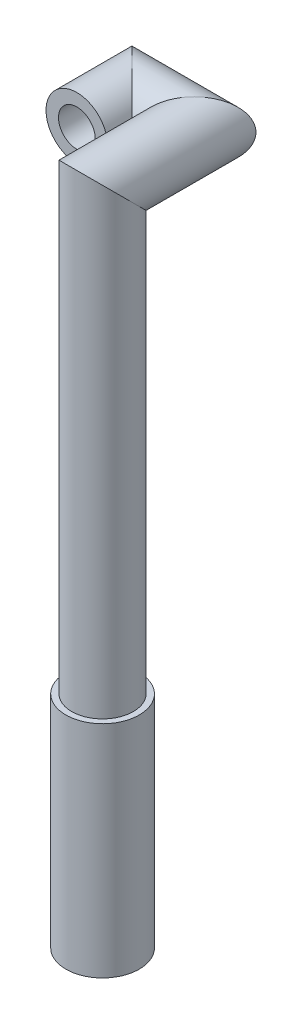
from build123d import *

# Parameters (mm, degrees)
SKETCH1_R           = 12.7
SKETCH1_R_2         = 6.35
BOSS_EXTRUDE1_DEPTH = 38.1
SKETCH2_R           = 10.668
CUT_EXTRUDE1_DEPTH  = 25.4
BOSS_EXTRUDE3_START = -25.4
SKETCH4_R           = 10.668
SKETCH4_R_2         = 6.35
BOSS_EXTRUDE3_DEPTH = 101.6
SKETCH5_R           = 10.668
SKETCH5_R_2         = 6.35


with BuildPart() as part:
    # Sketch1 → Boss-Extrude1 (new body)
    with BuildSketch(Plane(origin=(0, 0, 0), x_dir=(1, 0, 0), z_dir=(0, 1, 0))):
        with Locations(Location((0, 0, 0), (0, 0, 90))):
            Circle(SKETCH1_R)
        with Locations(Location((0, 0, 0), (0, 0, 90))):
            Circle(SKETCH1_R_2, mode=Mode.SUBTRACT)
    boss_extrude1 = extrude(amount=BOSS_EXTRUDE1_DEPTH)

    # Sketch2 → Cut-Extrude1 (cut)
    with BuildSketch(Plane(origin=(0, 38.1, 0), x_dir=(1, 0, 0), z_dir=(0, 1, 0))):
        with Locations(Location((0, 0, 0), (0, 0, 270))):
            Circle(SKETCH2_R)
    cut_extrude1 = extrude(amount=-CUT_EXTRUDE1_DEPTH, mode=Mode.SUBTRACT)

    # Mirror2: Boss-Extrude1, Cut-Extrude1 across plane
    add(boss_extrude1.mirror(Plane.ZX))
    add(cut_extrude1.mirror(Plane.ZX), mode=Mode.SUBTRACT)

    # Sketch4 → Boss-Extrude3 (add)
    with BuildSketch(Plane(origin=(0, 38.1, 0), x_dir=(1, 0, 0), z_dir=(0, 1, 0)).offset(BOSS_EXTRUDE3_START)):
        with Locations(Location((0, 0, 0), (0, 0, 270))):
            Circle(SKETCH4_R)
        with Locations(Location((0, 0, 0), (0, 0, 90))):
            Circle(SKETCH4_R_2, mode=Mode.SUBTRACT)
    extrude(amount=BOSS_EXTRUDE3_DEPTH)

    # Sweep1: sweep along a curve in space
    with BuildLine() as sweep1_path:
        Line((0, 114.3, 0), (0, 190.5, 0))
        Line((0, 190.5, 0), (0, 190.5, -31.75))
        Line((0, 190.5, -31.75), (-21.59, 190.5, -31.75))
        Line((-21.59, 190.5, -31.75), (-21.59, 190.5, -12.7))
    # Sketch5 → Sweep1 (sweep)
    with BuildSketch(Plane(origin=(0, 114.3, 0), x_dir=(1, 0, 0), z_dir=(0, 1, 0))):
        Circle(SKETCH5_R)
        Circle(SKETCH5_R_2, mode=Mode.SUBTRACT)
    sweep(path=sweep1_path.line, transition=Transition.RIGHT)


solid = part.part
